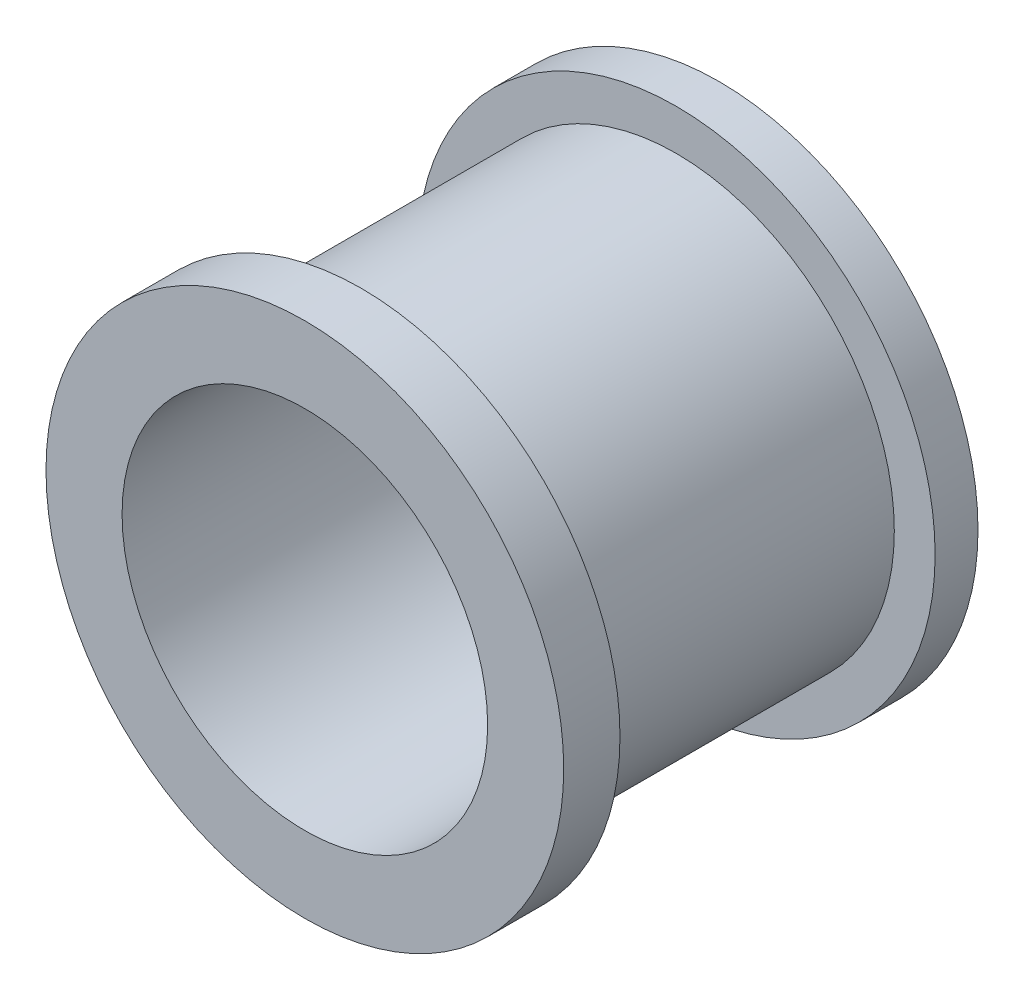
ISO-10303-21;
HEADER;
FILE_DESCRIPTION(('STEP AP214'),'2;1');
FILE_NAME('part.step','',(''),(''),'','','');
FILE_SCHEMA(('AUTOMOTIVE_DESIGN { 1 0 10303 214 1 1 1 1 }'));
ENDSEC;
DATA;
#1=APPLICATION_CONTEXT('core data for automotive mechanical design processes');
#2=APPLICATION_PROTOCOL_DEFINITION('international standard','automotive_design',2000,#1);
#3=PRODUCT_CONTEXT('',#1,'mechanical');
#4=PRODUCT('Part','Part','',(#3));
#5=PRODUCT_RELATED_PRODUCT_CATEGORY('part','',(#4));
#6=PRODUCT_DEFINITION_FORMATION('','',#4);
#7=PRODUCT_DEFINITION_CONTEXT('part definition',#1,'design');
#8=PRODUCT_DEFINITION('design','',#6,#7);
#9=PRODUCT_DEFINITION_SHAPE('','',#8);
#10=(LENGTH_UNIT() NAMED_UNIT(*) SI_UNIT(.MILLI.,.METRE.));
#11=(NAMED_UNIT(*) PLANE_ANGLE_UNIT() SI_UNIT($,.RADIAN.));
#12=(NAMED_UNIT(*) SI_UNIT($,.STERADIAN.) SOLID_ANGLE_UNIT());
#13=UNCERTAINTY_MEASURE_WITH_UNIT(LENGTH_MEASURE(1.E-05),#10,'distance_accuracy_value','');
#14=(GEOMETRIC_REPRESENTATION_CONTEXT(3) GLOBAL_UNCERTAINTY_ASSIGNED_CONTEXT((#13)) GLOBAL_UNIT_ASSIGNED_CONTEXT((#10,
#11,#12)) REPRESENTATION_CONTEXT('',''));
#15=CARTESIAN_POINT('',(0.,0.,0.));
#16=DIRECTION('',(0.,0.,1.));
#17=DIRECTION('',(1.,0.,0.));
#18=AXIS2_PLACEMENT_3D('',#15,#16,#17);
#19=CARTESIAN_POINT('',(9.2,0.,-14.724));
#20=DIRECTION('',(0.,0.,1.));
#21=DIRECTION('',(1.,0.,0.));
#22=AXIS2_PLACEMENT_3D('',#19,#20,#21);
#23=PLANE('',#22);
#24=CARTESIAN_POINT('',(0.,0.,-14.724));
#25=DIRECTION('',(0.,0.,-1.));
#26=DIRECTION('',(-1.,0.,0.));
#27=AXIS2_PLACEMENT_3D('',#24,#25,#26);
#28=CIRCLE('',#27,9.2);
#29=CARTESIAN_POINT('',(-9.2,0.,-14.724));
#30=VERTEX_POINT('',#29);
#31=EDGE_CURVE('E51',#30,#30,#28,.T.);
#32=ORIENTED_EDGE('',*,*,#31,.T.);
#33=EDGE_LOOP('',(#32));
#34=FACE_BOUND('',#33,.T.);
#35=CARTESIAN_POINT('',(0.,0.,-14.724));
#36=DIRECTION('',(0.,0.,-1.));
#37=DIRECTION('',(-1.,0.,0.));
#38=AXIS2_PLACEMENT_3D('',#35,#36,#37);
#39=CIRCLE('',#38,5.);
#40=CARTESIAN_POINT('',(-5.,0.,-14.724));
#41=VERTEX_POINT('',#40);
#42=EDGE_CURVE('E60',#41,#41,#39,.T.);
#43=ORIENTED_EDGE('',*,*,#42,.F.);
#44=EDGE_LOOP('',(#43));
#45=FACE_BOUND('',#44,.T.);
#46=ADVANCED_FACE('F28',(#34,#45),#23,.F.);
#47=CARTESIAN_POINT('',(0.,0.,-13.));
#48=DIRECTION('',(0.,0.,1.));
#49=DIRECTION('',(1.,0.,0.));
#50=AXIS2_PLACEMENT_3D('',#47,#48,#49);
#51=PLANE('',#50);
#52=CARTESIAN_POINT('',(0.,0.,-13.));
#53=DIRECTION('',(0.,0.,1.));
#54=DIRECTION('',(1.,0.,0.));
#55=AXIS2_PLACEMENT_3D('',#52,#53,#54);
#56=CIRCLE('',#55,6.49605);
#57=CARTESIAN_POINT('',(6.49605,0.,-13.));
#58=VERTEX_POINT('',#57);
#59=EDGE_CURVE('E54',#58,#58,#56,.T.);
#60=ORIENTED_EDGE('',*,*,#59,.T.);
#61=EDGE_LOOP('',(#60));
#62=FACE_BOUND('',#61,.T.);
#63=CARTESIAN_POINT('',(0.,0.,-13.));
#64=DIRECTION('',(0.,0.,-1.));
#65=DIRECTION('',(-1.,0.,0.));
#66=AXIS2_PLACEMENT_3D('',#63,#64,#65);
#67=CIRCLE('',#66,5.);
#68=CARTESIAN_POINT('',(-5.,0.,-13.));
#69=VERTEX_POINT('',#68);
#70=EDGE_CURVE('E63',#69,#69,#67,.T.);
#71=ORIENTED_EDGE('',*,*,#70,.T.);
#72=EDGE_LOOP('',(#71));
#73=FACE_BOUND('',#72,.T.);
#74=ADVANCED_FACE('F67',(#62,#73),#51,.T.);
#75=CARTESIAN_POINT('',(0.,0.,0.));
#76=DIRECTION('',(0.,0.,-1.));
#77=DIRECTION('',(-1.,0.,0.));
#78=AXIS2_PLACEMENT_3D('',#75,#76,#77);
#79=PLANE('',#78);
#80=CARTESIAN_POINT('',(0.,0.,0.));
#81=DIRECTION('',(0.,0.,1.));
#82=DIRECTION('',(1.,0.,0.));
#83=AXIS2_PLACEMENT_3D('',#80,#81,#82);
#84=CIRCLE('',#83,6.49605);
#85=CARTESIAN_POINT('',(6.49605,0.,0.));
#86=VERTEX_POINT('',#85);
#87=EDGE_CURVE('E57',#86,#86,#84,.T.);
#88=ORIENTED_EDGE('',*,*,#87,.F.);
#89=EDGE_LOOP('',(#88));
#90=FACE_BOUND('',#89,.T.);
#91=CARTESIAN_POINT('',(0.,0.,0.));
#92=DIRECTION('',(0.,0.,-1.));
#93=DIRECTION('',(-1.,0.,0.));
#94=AXIS2_PLACEMENT_3D('',#91,#92,#93);
#95=CIRCLE('',#94,9.2);
#96=CARTESIAN_POINT('',(-9.2,0.,0.));
#97=VERTEX_POINT('',#96);
#98=EDGE_CURVE('E10',#97,#97,#95,.T.);
#99=ORIENTED_EDGE('',*,*,#98,.F.);
#100=EDGE_LOOP('',(#99));
#101=FACE_BOUND('',#100,.T.);
#102=ADVANCED_FACE('F30',(#90,#101),#79,.F.);
#103=CARTESIAN_POINT('',(0.,0.,0.));
#104=DIRECTION('',(0.,0.,-1.));
#105=DIRECTION('',(-1.,0.,0.));
#106=AXIS2_PLACEMENT_3D('',#103,#104,#105);
#107=CYLINDRICAL_SURFACE('',#106,9.2);
#108=CARTESIAN_POINT('',(0.,0.,-2.));
#109=DIRECTION('',(0.,0.,-1.));
#110=DIRECTION('',(-1.,0.,0.));
#111=AXIS2_PLACEMENT_3D('',#108,#109,#110);
#112=CIRCLE('',#111,9.2);
#113=CARTESIAN_POINT('',(-9.2,0.,-2.));
#114=VERTEX_POINT('',#113);
#115=EDGE_CURVE('E35',#114,#114,#112,.T.);
#116=ORIENTED_EDGE('',*,*,#115,.F.);
#117=EDGE_LOOP('',(#116));
#118=FACE_BOUND('',#117,.T.);
#119=ORIENTED_EDGE('',*,*,#98,.T.);
#120=EDGE_LOOP('',(#119));
#121=FACE_BOUND('',#120,.T.);
#122=ADVANCED_FACE('F103',(#118,#121),#107,.T.);
#123=CARTESIAN_POINT('',(7.75,0.,-2.));
#124=DIRECTION('',(0.,0.,1.));
#125=DIRECTION('',(1.,0.,0.));
#126=AXIS2_PLACEMENT_3D('',#123,#124,#125);
#127=PLANE('',#126);
#128=CARTESIAN_POINT('',(0.,0.,-2.));
#129=DIRECTION('',(0.,0.,-1.));
#130=DIRECTION('',(-1.,0.,0.));
#131=AXIS2_PLACEMENT_3D('',#128,#129,#130);
#132=CIRCLE('',#131,7.75);
#133=CARTESIAN_POINT('',(-7.75,0.,-2.));
#134=VERTEX_POINT('',#133);
#135=EDGE_CURVE('E39',#134,#134,#132,.T.);
#136=ORIENTED_EDGE('',*,*,#135,.F.);
#137=EDGE_LOOP('',(#136));
#138=FACE_BOUND('',#137,.T.);
#139=ORIENTED_EDGE('',*,*,#115,.T.);
#140=EDGE_LOOP('',(#139));
#141=FACE_BOUND('',#140,.T.);
#142=ADVANCED_FACE('F100',(#138,#141),#127,.F.);
#143=CARTESIAN_POINT('',(0.,0.,0.));
#144=DIRECTION('',(0.,0.,-1.));
#145=DIRECTION('',(-1.,0.,0.));
#146=AXIS2_PLACEMENT_3D('',#143,#144,#145);
#147=CYLINDRICAL_SURFACE('',#146,7.75);
#148=CARTESIAN_POINT('',(0.,0.,-13.2));
#149=DIRECTION('',(0.,0.,-1.));
#150=DIRECTION('',(-1.,0.,0.));
#151=AXIS2_PLACEMENT_3D('',#148,#149,#150);
#152=CIRCLE('',#151,7.75);
#153=CARTESIAN_POINT('',(-7.75,0.,-13.2));
#154=VERTEX_POINT('',#153);
#155=EDGE_CURVE('E43',#154,#154,#152,.T.);
#156=ORIENTED_EDGE('',*,*,#155,.F.);
#157=EDGE_LOOP('',(#156));
#158=FACE_BOUND('',#157,.T.);
#159=ORIENTED_EDGE('',*,*,#135,.T.);
#160=EDGE_LOOP('',(#159));
#161=FACE_BOUND('',#160,.T.);
#162=ADVANCED_FACE('F96',(#158,#161),#147,.T.);
#163=CARTESIAN_POINT('',(7.75,0.,-13.2));
#164=DIRECTION('',(0.,0.,-1.));
#165=DIRECTION('',(-1.,0.,0.));
#166=AXIS2_PLACEMENT_3D('',#163,#164,#165);
#167=PLANE('',#166);
#168=CARTESIAN_POINT('',(0.,0.,-13.2));
#169=DIRECTION('',(0.,0.,-1.));
#170=DIRECTION('',(-1.,0.,0.));
#171=AXIS2_PLACEMENT_3D('',#168,#169,#170);
#172=CIRCLE('',#171,9.2);
#173=CARTESIAN_POINT('',(-9.2,0.,-13.2));
#174=VERTEX_POINT('',#173);
#175=EDGE_CURVE('E48',#174,#174,#172,.T.);
#176=ORIENTED_EDGE('',*,*,#175,.F.);
#177=EDGE_LOOP('',(#176));
#178=FACE_BOUND('',#177,.T.);
#179=ORIENTED_EDGE('',*,*,#155,.T.);
#180=EDGE_LOOP('',(#179));
#181=FACE_BOUND('',#180,.T.);
#182=ADVANCED_FACE('F92',(#178,#181),#167,.F.);
#183=CARTESIAN_POINT('',(0.,0.,0.));
#184=DIRECTION('',(0.,0.,-1.));
#185=DIRECTION('',(-1.,0.,0.));
#186=AXIS2_PLACEMENT_3D('',#183,#184,#185);
#187=CYLINDRICAL_SURFACE('',#186,9.2);
#188=ORIENTED_EDGE('',*,*,#31,.F.);
#189=EDGE_LOOP('',(#188));
#190=FACE_BOUND('',#189,.T.);
#191=ORIENTED_EDGE('',*,*,#175,.T.);
#192=EDGE_LOOP('',(#191));
#193=FACE_BOUND('',#192,.T.);
#194=ADVANCED_FACE('F77',(#190,#193),#187,.T.);
#195=CARTESIAN_POINT('',(0.,0.,-13.));
#196=DIRECTION('',(0.,0.,1.));
#197=DIRECTION('',(1.,0.,0.));
#198=AXIS2_PLACEMENT_3D('',#195,#196,#197);
#199=CYLINDRICAL_SURFACE('',#198,6.49605);
#200=CARTESIAN_POINT('',(6.49605,0.,-13.));
#201=CARTESIAN_POINT('',(6.49605,0.,-12.8645833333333));
#202=CARTESIAN_POINT('',(6.49605,0.,-12.7291666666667));
#203=CARTESIAN_POINT('',(6.49605,0.,-12.4583333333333));
#204=CARTESIAN_POINT('',(6.49605,0.,-12.3229166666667));
#205=CARTESIAN_POINT('',(6.49605,0.,-12.0520833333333));
#206=CARTESIAN_POINT('',(6.49605,0.,-11.9166666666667));
#207=CARTESIAN_POINT('',(6.49605,0.,-11.6458333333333));
#208=CARTESIAN_POINT('',(6.49605,0.,-11.5104166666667));
#209=CARTESIAN_POINT('',(6.49605,0.,-11.2395833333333));
#210=CARTESIAN_POINT('',(6.49605,0.,-11.1041666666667));
#211=CARTESIAN_POINT('',(6.49605,0.,-10.8333333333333));
#212=CARTESIAN_POINT('',(6.49605,0.,-10.6979166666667));
#213=CARTESIAN_POINT('',(6.49605,0.,-10.4270833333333));
#214=CARTESIAN_POINT('',(6.49605,0.,-10.2916666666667));
#215=CARTESIAN_POINT('',(6.49605,0.,-10.0208333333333));
#216=CARTESIAN_POINT('',(6.49605,0.,-9.88541666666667));
#217=CARTESIAN_POINT('',(6.49605,0.,-9.61458333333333));
#218=CARTESIAN_POINT('',(6.49605,0.,-9.47916666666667));
#219=CARTESIAN_POINT('',(6.49605,0.,-9.20833333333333));
#220=CARTESIAN_POINT('',(6.49605,0.,-9.07291666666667));
#221=CARTESIAN_POINT('',(6.49605,0.,-8.80208333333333));
#222=CARTESIAN_POINT('',(6.49605,0.,-8.66666666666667));
#223=CARTESIAN_POINT('',(6.49605,0.,-8.39583333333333));
#224=CARTESIAN_POINT('',(6.49605,0.,-8.26041666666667));
#225=CARTESIAN_POINT('',(6.49605,0.,-7.98958333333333));
#226=CARTESIAN_POINT('',(6.49605,0.,-7.85416666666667));
#227=CARTESIAN_POINT('',(6.49605,0.,-7.58333333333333));
#228=CARTESIAN_POINT('',(6.49605,0.,-7.44791666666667));
#229=CARTESIAN_POINT('',(6.49605,0.,-7.17708333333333));
#230=CARTESIAN_POINT('',(6.49605,0.,-7.04166666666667));
#231=CARTESIAN_POINT('',(6.49605,0.,-6.77083333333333));
#232=CARTESIAN_POINT('',(6.49605,0.,-6.63541666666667));
#233=CARTESIAN_POINT('',(6.49605,0.,-6.36458333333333));
#234=CARTESIAN_POINT('',(6.49605,0.,-6.22916666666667));
#235=CARTESIAN_POINT('',(6.49605,0.,-5.95833333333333));
#236=CARTESIAN_POINT('',(6.49605,0.,-5.82291666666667));
#237=CARTESIAN_POINT('',(6.49605,0.,-5.55208333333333));
#238=CARTESIAN_POINT('',(6.49605,0.,-5.41666666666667));
#239=CARTESIAN_POINT('',(6.49605,0.,-5.14583333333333));
#240=CARTESIAN_POINT('',(6.49605,0.,-5.01041666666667));
#241=CARTESIAN_POINT('',(6.49605,0.,-4.73958333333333));
#242=CARTESIAN_POINT('',(6.49605,0.,-4.60416666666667));
#243=CARTESIAN_POINT('',(6.49605,0.,-4.33333333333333));
#244=CARTESIAN_POINT('',(6.49605,0.,-4.19791666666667));
#245=CARTESIAN_POINT('',(6.49605,0.,-3.92708333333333));
#246=CARTESIAN_POINT('',(6.49605,0.,-3.79166666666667));
#247=CARTESIAN_POINT('',(6.49605,0.,-3.52083333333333));
#248=CARTESIAN_POINT('',(6.49605,0.,-3.38541666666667));
#249=CARTESIAN_POINT('',(6.49605,0.,-3.11458333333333));
#250=CARTESIAN_POINT('',(6.49605,0.,-2.97916666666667));
#251=CARTESIAN_POINT('',(6.49605,0.,-2.70833333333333));
#252=CARTESIAN_POINT('',(6.49605,0.,-2.57291666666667));
#253=CARTESIAN_POINT('',(6.49605,0.,-2.30208333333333));
#254=CARTESIAN_POINT('',(6.49605,0.,-2.16666666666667));
#255=CARTESIAN_POINT('',(6.49605,0.,-1.89583333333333));
#256=CARTESIAN_POINT('',(6.49605,0.,-1.76041666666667));
#257=CARTESIAN_POINT('',(6.49605,0.,-1.48958333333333));
#258=CARTESIAN_POINT('',(6.49605,0.,-1.35416666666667));
#259=CARTESIAN_POINT('',(6.49605,0.,-1.08333333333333));
#260=CARTESIAN_POINT('',(6.49605,0.,-0.947916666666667));
#261=CARTESIAN_POINT('',(6.49605,0.,-0.677083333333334));
#262=CARTESIAN_POINT('',(6.49605,0.,-0.541666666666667));
#263=CARTESIAN_POINT('',(6.49605,0.,-0.270833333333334));
#264=CARTESIAN_POINT('',(6.49605,0.,-0.135416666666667));
#265=CARTESIAN_POINT('',(6.49605,0.,0.));
#266=B_SPLINE_CURVE_WITH_KNOTS('',3,(#200,#201,#202,#203,#204,#205,#206,#207,#208,#209,#210,
#211,#212,#213,#214,#215,#216,#217,#218,#219,#220,#221,#222,#223,#224,#225,#226,#227,#228,#229,
#230,#231,#232,#233,#234,#235,#236,#237,#238,#239,#240,#241,#242,#243,#244,#245,#246,#247,#248,
#249,#250,#251,#252,#253,#254,#255,#256,#257,#258,#259,#260,#261,#262,#263,#264,#265),
.UNSPECIFIED.,.F.,.F.,(4,2,2,2,2,2,2,2,2,2,2,2,2,2,2,2,2,2,2,2,2,2,2,2,2,2,2,2,2,2,2,2,4),(0.,
0.40625,0.812500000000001,1.21875,1.625,2.03125,2.4375,2.84375,3.25,3.65625,4.0625,4.46875,
4.875,5.28125,5.6875,6.09375,6.5,6.90625,7.3125,7.71875,8.125,8.53125,8.9375,9.34375,9.75,
10.15625,10.5625,10.96875,11.375,11.78125,12.1875,12.59375,13.),.UNSPECIFIED.);
#267=EDGE_CURVE('BSEAM71',#58,#86,#266,.T.);
#268=ORIENTED_EDGE('',*,*,#59,.F.);
#269=ORIENTED_EDGE('',*,*,#87,.T.);
#270=ORIENTED_EDGE('',*,*,#267,.T.);
#271=ORIENTED_EDGE('',*,*,#267,.F.);
#272=EDGE_LOOP('',(#268,#270,#269,#271));
#273=FACE_BOUND('',#272,.T.);
#274=ADVANCED_FACE('F71',(#273),#199,.F.);
#275=CARTESIAN_POINT('',(0.,0.,-14.724));
#276=DIRECTION('',(0.,0.,1.));
#277=DIRECTION('',(1.,0.,0.));
#278=AXIS2_PLACEMENT_3D('',#275,#276,#277);
#279=CYLINDRICAL_SURFACE('',#278,5.);
#280=ORIENTED_EDGE('',*,*,#42,.T.);
#281=EDGE_LOOP('',(#280));
#282=FACE_BOUND('',#281,.T.);
#283=ORIENTED_EDGE('',*,*,#70,.F.);
#284=EDGE_LOOP('',(#283));
#285=FACE_BOUND('',#284,.T.);
#286=ADVANCED_FACE('F69',(#282,#285),#279,.F.);
#287=CLOSED_SHELL('',(#46,#74,#102,#122,#142,#162,#182,#194,#274,#286));
#288=MANIFOLD_SOLID_BREP('B2',#287);
#289=ADVANCED_BREP_SHAPE_REPRESENTATION('',(#18,#288),#14);
#290=SHAPE_DEFINITION_REPRESENTATION(#9,#289);
ENDSEC;
END-ISO-10303-21;
